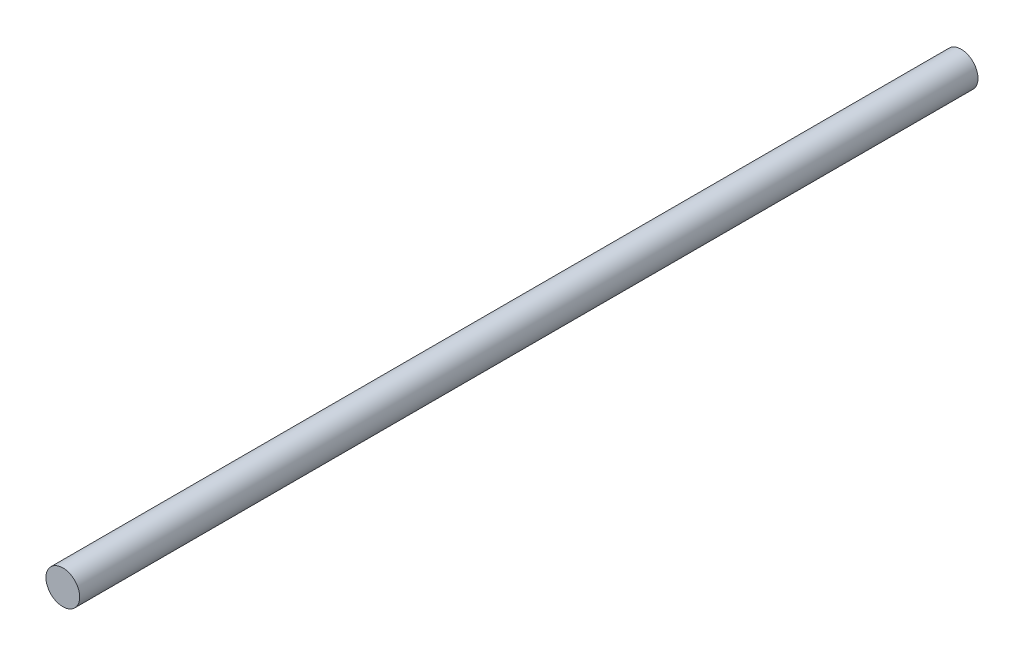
ISO-10303-21;
HEADER;
FILE_DESCRIPTION(('STEP AP214'),'2;1');
FILE_NAME('part.step','',(''),(''),'','','');
FILE_SCHEMA(('AUTOMOTIVE_DESIGN { 1 0 10303 214 1 1 1 1 }'));
ENDSEC;
DATA;
#1=APPLICATION_CONTEXT('core data for automotive mechanical design processes');
#2=APPLICATION_PROTOCOL_DEFINITION('international standard','automotive_design',2000,#1);
#3=PRODUCT_CONTEXT('',#1,'mechanical');
#4=PRODUCT('Part','Part','',(#3));
#5=PRODUCT_RELATED_PRODUCT_CATEGORY('part','',(#4));
#6=PRODUCT_DEFINITION_FORMATION('','',#4);
#7=PRODUCT_DEFINITION_CONTEXT('part definition',#1,'design');
#8=PRODUCT_DEFINITION('design','',#6,#7);
#9=PRODUCT_DEFINITION_SHAPE('','',#8);
#10=(LENGTH_UNIT() NAMED_UNIT(*) SI_UNIT(.MILLI.,.METRE.));
#11=(NAMED_UNIT(*) PLANE_ANGLE_UNIT() SI_UNIT($,.RADIAN.));
#12=(NAMED_UNIT(*) SI_UNIT($,.STERADIAN.) SOLID_ANGLE_UNIT());
#13=UNCERTAINTY_MEASURE_WITH_UNIT(LENGTH_MEASURE(1.E-05),#10,'distance_accuracy_value','');
#14=(GEOMETRIC_REPRESENTATION_CONTEXT(3) GLOBAL_UNCERTAINTY_ASSIGNED_CONTEXT((#13)) GLOBAL_UNIT_ASSIGNED_CONTEXT((#10,
#11,#12)) REPRESENTATION_CONTEXT('',''));
#15=CARTESIAN_POINT('',(0.,0.,0.));
#16=DIRECTION('',(0.,0.,1.));
#17=DIRECTION('',(1.,0.,0.));
#18=AXIS2_PLACEMENT_3D('',#15,#16,#17);
#19=CARTESIAN_POINT('',(0.,0.,42.299999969));
#20=DIRECTION('',(0.,0.,-1.));
#21=DIRECTION('',(-1.,0.,0.));
#22=AXIS2_PLACEMENT_3D('',#19,#20,#21);
#23=CYLINDRICAL_SURFACE('',#22,1.5875);
#24=CARTESIAN_POINT('',(0.,0.,42.299999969));
#25=DIRECTION('',(0.,0.,1.));
#26=DIRECTION('',(1.,0.,0.));
#27=AXIS2_PLACEMENT_3D('',#24,#25,#26);
#28=CIRCLE('',#27,1.5875);
#29=CARTESIAN_POINT('',(1.5875,0.,42.299999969));
#30=VERTEX_POINT('',#29);
#31=EDGE_CURVE('E10',#30,#30,#28,.T.);
#32=ORIENTED_EDGE('',*,*,#31,.F.);
#33=EDGE_LOOP('',(#32));
#34=FACE_BOUND('',#33,.T.);
#35=CARTESIAN_POINT('',(0.,0.,-42.299999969));
#36=DIRECTION('',(0.,0.,1.));
#37=DIRECTION('',(1.,0.,0.));
#38=AXIS2_PLACEMENT_3D('',#35,#36,#37);
#39=CIRCLE('',#38,1.5875);
#40=CARTESIAN_POINT('',(1.5875,0.,-42.299999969));
#41=VERTEX_POINT('',#40);
#42=EDGE_CURVE('E33',#41,#41,#39,.T.);
#43=ORIENTED_EDGE('',*,*,#42,.T.);
#44=EDGE_LOOP('',(#43));
#45=FACE_BOUND('',#44,.T.);
#46=ADVANCED_FACE('F30',(#34,#45),#23,.T.);
#47=CARTESIAN_POINT('',(0.,0.,42.299999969));
#48=DIRECTION('',(0.,0.,1.));
#49=DIRECTION('',(1.,0.,0.));
#50=AXIS2_PLACEMENT_3D('',#47,#48,#49);
#51=PLANE('',#50);
#52=ORIENTED_EDGE('',*,*,#31,.T.);
#53=EDGE_LOOP('',(#52));
#54=FACE_BOUND('',#53,.T.);
#55=ADVANCED_FACE('F45',(#54),#51,.T.);
#56=CARTESIAN_POINT('',(0.,0.,-42.299999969));
#57=DIRECTION('',(0.,0.,1.));
#58=DIRECTION('',(1.,0.,0.));
#59=AXIS2_PLACEMENT_3D('',#56,#57,#58);
#60=PLANE('',#59);
#61=ORIENTED_EDGE('',*,*,#42,.F.);
#62=EDGE_LOOP('',(#61));
#63=FACE_BOUND('',#62,.T.);
#64=ADVANCED_FACE('F43',(#63),#60,.F.);
#65=CLOSED_SHELL('',(#46,#55,#64));
#66=MANIFOLD_SOLID_BREP('B2',#65);
#67=ADVANCED_BREP_SHAPE_REPRESENTATION('',(#18,#66),#14);
#68=SHAPE_DEFINITION_REPRESENTATION(#9,#67);
ENDSEC;
END-ISO-10303-21;
